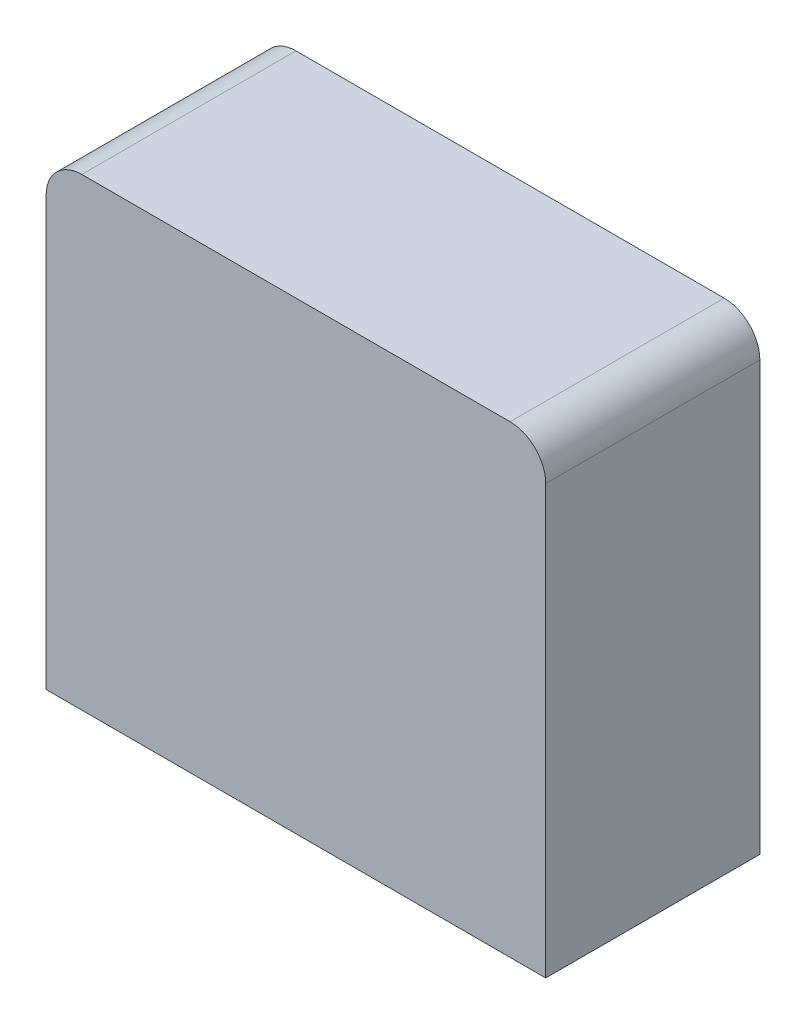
ISO-10303-21;
HEADER;
FILE_DESCRIPTION(('STEP AP214'),'2;1');
FILE_NAME('part.step','',(''),(''),'','','');
FILE_SCHEMA(('AUTOMOTIVE_DESIGN { 1 0 10303 214 1 1 1 1 }'));
ENDSEC;
DATA;
#1=APPLICATION_CONTEXT('core data for automotive mechanical design processes');
#2=APPLICATION_PROTOCOL_DEFINITION('international standard','automotive_design',2000,#1);
#3=PRODUCT_CONTEXT('',#1,'mechanical');
#4=PRODUCT('Part','Part','',(#3));
#5=PRODUCT_RELATED_PRODUCT_CATEGORY('part','',(#4));
#6=PRODUCT_DEFINITION_FORMATION('','',#4);
#7=PRODUCT_DEFINITION_CONTEXT('part definition',#1,'design');
#8=PRODUCT_DEFINITION('design','',#6,#7);
#9=PRODUCT_DEFINITION_SHAPE('','',#8);
#10=(LENGTH_UNIT() NAMED_UNIT(*) SI_UNIT(.MILLI.,.METRE.));
#11=(NAMED_UNIT(*) PLANE_ANGLE_UNIT() SI_UNIT($,.RADIAN.));
#12=(NAMED_UNIT(*) SI_UNIT($,.STERADIAN.) SOLID_ANGLE_UNIT());
#13=UNCERTAINTY_MEASURE_WITH_UNIT(LENGTH_MEASURE(1.E-05),#10,'distance_accuracy_value','');
#14=(GEOMETRIC_REPRESENTATION_CONTEXT(3) GLOBAL_UNCERTAINTY_ASSIGNED_CONTEXT((#13)) GLOBAL_UNIT_ASSIGNED_CONTEXT((#10,
#11,#12)) REPRESENTATION_CONTEXT('',''));
#15=CARTESIAN_POINT('',(0.,0.,0.));
#16=DIRECTION('',(0.,0.,1.));
#17=DIRECTION('',(1.,0.,0.));
#18=AXIS2_PLACEMENT_3D('',#15,#16,#17);
#19=CARTESIAN_POINT('',(0.,0.,0.));
#20=DIRECTION('',(0.,-1.,0.));
#21=DIRECTION('',(0.,0.,-1.));
#22=AXIS2_PLACEMENT_3D('',#19,#20,#21);
#23=PLANE('',#22);
#24=CARTESIAN_POINT('',(3.,0.,-3.));
#25=DIRECTION('',(0.,1.,0.));
#26=DIRECTION('',(0.,0.,1.));
#27=AXIS2_PLACEMENT_3D('',#24,#25,#26);
#28=CIRCLE('',#27,1.6);
#29=CARTESIAN_POINT('',(3.,0.,-1.4));
#30=VERTEX_POINT('',#29);
#31=EDGE_CURVE('E107',#30,#30,#28,.T.);
#32=ORIENTED_EDGE('',*,*,#31,.T.);
#33=EDGE_LOOP('',(#32));
#34=FACE_BOUND('',#33,.T.);
#35=DIRECTION('',(0.,0.,1.));
#36=VECTOR('',#35,1.);
#37=CARTESIAN_POINT('',(0.,0.,0.));
#38=LINE('',#37,#36);
#39=CARTESIAN_POINT('',(0.,0.,-6.));
#40=VERTEX_POINT('',#39);
#41=CARTESIAN_POINT('',(0.,0.,0.));
#42=VERTEX_POINT('',#41);
#43=EDGE_CURVE('E99',#40,#42,#38,.T.);
#44=ORIENTED_EDGE('',*,*,#43,.F.);
#45=DIRECTION('',(-1.,0.,0.));
#46=VECTOR('',#45,1.);
#47=CARTESIAN_POINT('',(0.,0.,-6.));
#48=LINE('',#47,#46);
#49=CARTESIAN_POINT('',(14.,0.,-6.));
#50=VERTEX_POINT('',#49);
#51=EDGE_CURVE('E115',#50,#40,#48,.T.);
#52=ORIENTED_EDGE('',*,*,#51,.F.);
#53=DIRECTION('',(0.,0.,-1.));
#54=VECTOR('',#53,1.);
#55=CARTESIAN_POINT('',(14.,0.,0.));
#56=LINE('',#55,#54);
#57=CARTESIAN_POINT('',(14.,0.,0.));
#58=VERTEX_POINT('',#57);
#59=EDGE_CURVE('E101',#58,#50,#56,.T.);
#60=ORIENTED_EDGE('',*,*,#59,.F.);
#61=DIRECTION('',(1.,0.,0.));
#62=VECTOR('',#61,1.);
#63=CARTESIAN_POINT('',(0.,0.,0.));
#64=LINE('',#63,#62);
#65=EDGE_CURVE('E87',#42,#58,#64,.T.);
#66=ORIENTED_EDGE('',*,*,#65,.F.);
#67=EDGE_LOOP('',(#44,#52,#60,#66));
#68=FACE_BOUND('',#67,.T.);
#69=CARTESIAN_POINT('',(11.,0.,-3.));
#70=DIRECTION('',(0.,1.,0.));
#71=DIRECTION('',(0.,0.,1.));
#72=AXIS2_PLACEMENT_3D('',#69,#70,#71);
#73=CIRCLE('',#72,1.6);
#74=CARTESIAN_POINT('',(11.,0.,-1.4));
#75=VERTEX_POINT('',#74);
#76=EDGE_CURVE('E110',#75,#75,#73,.T.);
#77=ORIENTED_EDGE('',*,*,#76,.T.);
#78=EDGE_LOOP('',(#77));
#79=FACE_BOUND('',#78,.T.);
#80=ADVANCED_FACE('F33',(#34,#68,#79),#23,.T.);
#81=CARTESIAN_POINT('',(0.,10.,0.));
#82=DIRECTION('',(1.,0.,0.));
#83=DIRECTION('',(0.,0.,-1.));
#84=AXIS2_PLACEMENT_3D('',#81,#82,#83);
#85=PLANE('',#84);
#86=DIRECTION('',(0.,-1.,0.));
#87=VECTOR('',#86,1.);
#88=CARTESIAN_POINT('',(0.,10.,0.));
#89=LINE('',#88,#87);
#90=CARTESIAN_POINT('',(0.,12.,0.));
#91=VERTEX_POINT('',#90);
#92=EDGE_CURVE('E84',#91,#42,#89,.T.);
#93=ORIENTED_EDGE('',*,*,#92,.F.);
#94=DIRECTION('',(0.,0.,1.));
#95=VECTOR('',#94,1.);
#96=CARTESIAN_POINT('',(0.,12.,-6.));
#97=LINE('',#96,#95);
#98=CARTESIAN_POINT('',(0.,12.,-6.));
#99=VERTEX_POINT('',#98);
#100=EDGE_CURVE('E11',#91,#99,#97,.F.);
#101=ORIENTED_EDGE('',*,*,#100,.T.);
#102=DIRECTION('',(0.,-1.,0.));
#103=VECTOR('',#102,1.);
#104=CARTESIAN_POINT('',(0.,10.,-6.));
#105=LINE('',#104,#103);
#106=EDGE_CURVE('E105',#99,#40,#105,.T.);
#107=ORIENTED_EDGE('',*,*,#106,.T.);
#108=ORIENTED_EDGE('',*,*,#43,.T.);
#109=EDGE_LOOP('',(#93,#101,#107,#108));
#110=FACE_BOUND('',#109,.T.);
#111=ADVANCED_FACE('F103',(#110),#85,.F.);
#112=CARTESIAN_POINT('',(0.,10.,0.));
#113=DIRECTION('',(0.,0.,-1.));
#114=DIRECTION('',(-1.,0.,0.));
#115=AXIS2_PLACEMENT_3D('',#112,#113,#114);
#116=PLANE('',#115);
#117=DIRECTION('',(0.,-1.,0.));
#118=VECTOR('',#117,1.);
#119=CARTESIAN_POINT('',(14.,10.,0.));
#120=LINE('',#119,#118);
#121=CARTESIAN_POINT('',(14.,12.,0.));
#122=VERTEX_POINT('',#121);
#123=EDGE_CURVE('E93',#122,#58,#120,.T.);
#124=ORIENTED_EDGE('',*,*,#123,.F.);
#125=CARTESIAN_POINT('',(13.,12.,0.));
#126=DIRECTION('',(0.,0.,-1.));
#127=DIRECTION('',(-1.,0.,0.));
#128=AXIS2_PLACEMENT_3D('',#125,#126,#127);
#129=CIRCLE('',#128,1.);
#130=CARTESIAN_POINT('',(13.,13.,0.));
#131=VERTEX_POINT('',#130);
#132=EDGE_CURVE('E41',#122,#131,#129,.F.);
#133=ORIENTED_EDGE('',*,*,#132,.T.);
#134=DIRECTION('',(1.,0.,0.));
#135=VECTOR('',#134,1.);
#136=CARTESIAN_POINT('',(0.,13.,0.));
#137=LINE('',#136,#135);
#138=CARTESIAN_POINT('',(1.,13.,0.));
#139=VERTEX_POINT('',#138);
#140=EDGE_CURVE('E133',#139,#131,#137,.T.);
#141=ORIENTED_EDGE('',*,*,#140,.F.);
#142=CARTESIAN_POINT('',(1.,12.,0.));
#143=DIRECTION('',(0.,0.,-1.));
#144=DIRECTION('',(-1.,0.,0.));
#145=AXIS2_PLACEMENT_3D('',#142,#143,#144);
#146=CIRCLE('',#145,1.);
#147=EDGE_CURVE('E48',#139,#91,#146,.F.);
#148=ORIENTED_EDGE('',*,*,#147,.T.);
#149=ORIENTED_EDGE('',*,*,#92,.T.);
#150=ORIENTED_EDGE('',*,*,#65,.T.);
#151=EDGE_LOOP('',(#124,#133,#141,#148,#149,#150));
#152=FACE_BOUND('',#151,.T.);
#153=ADVANCED_FACE('F86',(#152),#116,.F.);
#154=CARTESIAN_POINT('',(14.,10.,0.));
#155=DIRECTION('',(-1.,0.,0.));
#156=DIRECTION('',(0.,0.,1.));
#157=AXIS2_PLACEMENT_3D('',#154,#155,#156);
#158=PLANE('',#157);
#159=DIRECTION('',(0.,-1.,0.));
#160=VECTOR('',#159,1.);
#161=CARTESIAN_POINT('',(14.,10.,-6.));
#162=LINE('',#161,#160);
#163=CARTESIAN_POINT('',(14.,12.,-6.));
#164=VERTEX_POINT('',#163);
#165=EDGE_CURVE('E118',#164,#50,#162,.T.);
#166=ORIENTED_EDGE('',*,*,#165,.F.);
#167=DIRECTION('',(0.,0.,-1.));
#168=VECTOR('',#167,1.);
#169=CARTESIAN_POINT('',(14.,12.,0.));
#170=LINE('',#169,#168);
#171=EDGE_CURVE('E56',#164,#122,#170,.F.);
#172=ORIENTED_EDGE('',*,*,#171,.T.);
#173=ORIENTED_EDGE('',*,*,#123,.T.);
#174=ORIENTED_EDGE('',*,*,#59,.T.);
#175=EDGE_LOOP('',(#166,#172,#173,#174));
#176=FACE_BOUND('',#175,.T.);
#177=ADVANCED_FACE('F147',(#176),#158,.F.);
#178=CARTESIAN_POINT('',(0.,10.,-6.));
#179=DIRECTION('',(0.,0.,1.));
#180=DIRECTION('',(1.,0.,0.));
#181=AXIS2_PLACEMENT_3D('',#178,#179,#180);
#182=PLANE('',#181);
#183=DIRECTION('',(-1.,0.,0.));
#184=VECTOR('',#183,1.);
#185=CARTESIAN_POINT('',(14.,13.,-6.));
#186=LINE('',#185,#184);
#187=CARTESIAN_POINT('',(13.,13.,-6.));
#188=VERTEX_POINT('',#187);
#189=CARTESIAN_POINT('',(0.999999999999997,13.,-6.));
#190=VERTEX_POINT('',#189);
#191=EDGE_CURVE('E142',#188,#190,#186,.T.);
#192=ORIENTED_EDGE('',*,*,#191,.F.);
#193=CARTESIAN_POINT('',(13.,12.,-6.));
#194=DIRECTION('',(0.,0.,1.));
#195=DIRECTION('',(1.,0.,0.));
#196=AXIS2_PLACEMENT_3D('',#193,#194,#195);
#197=CIRCLE('',#196,1.);
#198=EDGE_CURVE('E128',#188,#164,#197,.F.);
#199=ORIENTED_EDGE('',*,*,#198,.T.);
#200=ORIENTED_EDGE('',*,*,#165,.T.);
#201=ORIENTED_EDGE('',*,*,#51,.T.);
#202=ORIENTED_EDGE('',*,*,#106,.F.);
#203=CARTESIAN_POINT('',(0.999999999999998,12.,-6.));
#204=DIRECTION('',(0.,0.,1.));
#205=DIRECTION('',(1.,0.,0.));
#206=AXIS2_PLACEMENT_3D('',#203,#204,#205);
#207=CIRCLE('',#206,1.);
#208=EDGE_CURVE('E126',#99,#190,#207,.F.);
#209=ORIENTED_EDGE('',*,*,#208,.T.);
#210=EDGE_LOOP('',(#192,#199,#200,#201,#202,#209));
#211=FACE_BOUND('',#210,.T.);
#212=ADVANCED_FACE('F146',(#211),#182,.F.);
#213=CARTESIAN_POINT('',(3.,10.,-3.));
#214=DIRECTION('',(0.,-1.,0.));
#215=DIRECTION('',(0.,0.,-1.));
#216=AXIS2_PLACEMENT_3D('',#213,#214,#215);
#217=CYLINDRICAL_SURFACE('',#216,1.6);
#218=CARTESIAN_POINT('',(3.,10.,-3.));
#219=DIRECTION('',(0.,1.,0.));
#220=DIRECTION('',(0.,0.,1.));
#221=AXIS2_PLACEMENT_3D('',#218,#219,#220);
#222=CIRCLE('',#221,1.6);
#223=CARTESIAN_POINT('',(3.,10.,-1.4));
#224=VERTEX_POINT('',#223);
#225=EDGE_CURVE('E266',#224,#224,#222,.T.);
#226=ORIENTED_EDGE('',*,*,#225,.T.);
#227=EDGE_LOOP('',(#226));
#228=FACE_BOUND('',#227,.T.);
#229=ORIENTED_EDGE('',*,*,#31,.F.);
#230=EDGE_LOOP('',(#229));
#231=FACE_BOUND('',#230,.T.);
#232=ADVANCED_FACE('F163',(#228,#231),#217,.F.);
#233=CARTESIAN_POINT('',(11.,10.,-3.));
#234=DIRECTION('',(0.,-1.,0.));
#235=DIRECTION('',(0.,0.,-1.));
#236=AXIS2_PLACEMENT_3D('',#233,#234,#235);
#237=CYLINDRICAL_SURFACE('',#236,1.6);
#238=CARTESIAN_POINT('',(11.,10.,-3.));
#239=DIRECTION('',(0.,1.,0.));
#240=DIRECTION('',(0.,0.,1.));
#241=AXIS2_PLACEMENT_3D('',#238,#239,#240);
#242=CIRCLE('',#241,1.6);
#243=CARTESIAN_POINT('',(11.,10.,-1.4));
#244=VERTEX_POINT('',#243);
#245=EDGE_CURVE('E141',#244,#244,#242,.T.);
#246=ORIENTED_EDGE('',*,*,#245,.T.);
#247=EDGE_LOOP('',(#246));
#248=FACE_BOUND('',#247,.T.);
#249=ORIENTED_EDGE('',*,*,#76,.F.);
#250=EDGE_LOOP('',(#249));
#251=FACE_BOUND('',#250,.T.);
#252=ADVANCED_FACE('F189',(#248,#251),#237,.F.);
#253=CARTESIAN_POINT('',(0.,10.,0.));
#254=DIRECTION('',(0.,1.,0.));
#255=DIRECTION('',(0.,0.,1.));
#256=AXIS2_PLACEMENT_3D('',#253,#254,#255);
#257=PLANE('',#256);
#258=ORIENTED_EDGE('',*,*,#245,.F.);
#259=EDGE_LOOP('',(#258));
#260=FACE_BOUND('',#259,.T.);
#261=ADVANCED_FACE('F196',(#260),#257,.F.);
#262=ORIENTED_EDGE('',*,*,#225,.F.);
#263=EDGE_LOOP('',(#262));
#264=FACE_BOUND('',#263,.T.);
#265=ADVANCED_FACE('F203',(#264),#257,.F.);
#266=CARTESIAN_POINT('',(0.,13.,0.));
#267=DIRECTION('',(0.,1.,0.));
#268=DIRECTION('',(0.,0.,1.));
#269=AXIS2_PLACEMENT_3D('',#266,#267,#268);
#270=PLANE('',#269);
#271=ORIENTED_EDGE('',*,*,#140,.T.);
#272=DIRECTION('',(0.,0.,-1.));
#273=VECTOR('',#272,1.);
#274=CARTESIAN_POINT('',(13.,13.,-6.));
#275=LINE('',#274,#273);
#276=EDGE_CURVE('E123',#131,#188,#275,.T.);
#277=ORIENTED_EDGE('',*,*,#276,.T.);
#278=ORIENTED_EDGE('',*,*,#191,.T.);
#279=DIRECTION('',(0.,0.,1.));
#280=VECTOR('',#279,1.);
#281=CARTESIAN_POINT('',(1.,13.,0.));
#282=LINE('',#281,#280);
#283=EDGE_CURVE('E92',#190,#139,#282,.T.);
#284=ORIENTED_EDGE('',*,*,#283,.T.);
#285=EDGE_LOOP('',(#271,#277,#278,#284));
#286=FACE_BOUND('',#285,.T.);
#287=ADVANCED_FACE('F137',(#286),#270,.T.);
#288=CARTESIAN_POINT('',(13.,12.,0.));
#289=DIRECTION('',(0.,0.,1.));
#290=DIRECTION('',(1.,0.,0.));
#291=AXIS2_PLACEMENT_3D('',#288,#289,#290);
#292=CYLINDRICAL_SURFACE('',#291,1.);
#293=ORIENTED_EDGE('',*,*,#132,.F.);
#294=ORIENTED_EDGE('',*,*,#171,.F.);
#295=ORIENTED_EDGE('',*,*,#198,.F.);
#296=ORIENTED_EDGE('',*,*,#276,.F.);
#297=EDGE_LOOP('',(#293,#294,#295,#296));
#298=FACE_BOUND('',#297,.T.);
#299=ADVANCED_FACE('F144',(#298),#292,.T.);
#300=CARTESIAN_POINT('',(1.,12.,0.));
#301=DIRECTION('',(0.,0.,-1.));
#302=DIRECTION('',(-1.,0.,0.));
#303=AXIS2_PLACEMENT_3D('',#300,#301,#302);
#304=CYLINDRICAL_SURFACE('',#303,1.);
#305=ORIENTED_EDGE('',*,*,#208,.F.);
#306=ORIENTED_EDGE('',*,*,#100,.F.);
#307=ORIENTED_EDGE('',*,*,#147,.F.);
#308=ORIENTED_EDGE('',*,*,#283,.F.);
#309=EDGE_LOOP('',(#305,#306,#307,#308));
#310=FACE_BOUND('',#309,.T.);
#311=ADVANCED_FACE('F35',(#310),#304,.T.);
#312=CLOSED_SHELL('',(#80,#111,#153,#177,#212,#232,#252,#261,#265,#287,#299,#311));
#313=MANIFOLD_SOLID_BREP('B2',#312);
#314=ADVANCED_BREP_SHAPE_REPRESENTATION('',(#18,#313),#14);
#315=SHAPE_DEFINITION_REPRESENTATION(#9,#314);
ENDSEC;
END-ISO-10303-21;
